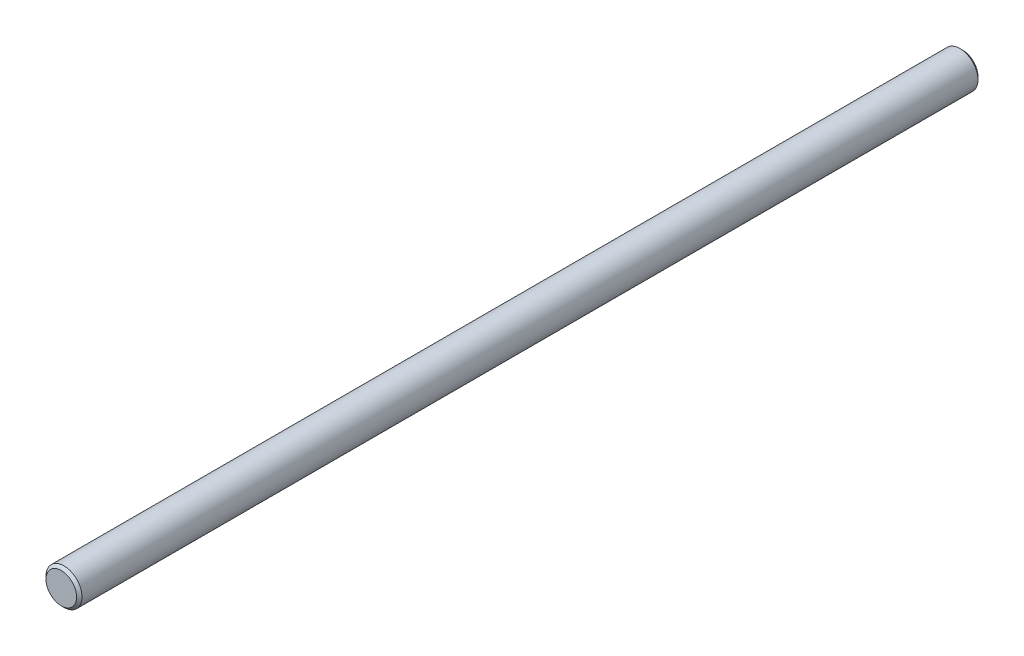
ISO-10303-21;
HEADER;
FILE_DESCRIPTION(('STEP AP214'),'2;1');
FILE_NAME('part.step','',(''),(''),'','','');
FILE_SCHEMA(('AUTOMOTIVE_DESIGN { 1 0 10303 214 1 1 1 1 }'));
ENDSEC;
DATA;
#1=APPLICATION_CONTEXT('core data for automotive mechanical design processes');
#2=APPLICATION_PROTOCOL_DEFINITION('international standard','automotive_design',2000,#1);
#3=PRODUCT_CONTEXT('',#1,'mechanical');
#4=PRODUCT('Part','Part','',(#3));
#5=PRODUCT_RELATED_PRODUCT_CATEGORY('part','',(#4));
#6=PRODUCT_DEFINITION_FORMATION('','',#4);
#7=PRODUCT_DEFINITION_CONTEXT('part definition',#1,'design');
#8=PRODUCT_DEFINITION('design','',#6,#7);
#9=PRODUCT_DEFINITION_SHAPE('','',#8);
#10=(LENGTH_UNIT() NAMED_UNIT(*) SI_UNIT(.MILLI.,.METRE.));
#11=(NAMED_UNIT(*) PLANE_ANGLE_UNIT() SI_UNIT($,.RADIAN.));
#12=(NAMED_UNIT(*) SI_UNIT($,.STERADIAN.) SOLID_ANGLE_UNIT());
#13=UNCERTAINTY_MEASURE_WITH_UNIT(LENGTH_MEASURE(1.E-05),#10,'distance_accuracy_value','');
#14=(GEOMETRIC_REPRESENTATION_CONTEXT(3) GLOBAL_UNCERTAINTY_ASSIGNED_CONTEXT((#13)) GLOBAL_UNIT_ASSIGNED_CONTEXT((#10,
#11,#12)) REPRESENTATION_CONTEXT('',''));
#15=CARTESIAN_POINT('',(0.,0.,0.));
#16=DIRECTION('',(0.,0.,1.));
#17=DIRECTION('',(1.,0.,0.));
#18=AXIS2_PLACEMENT_3D('',#15,#16,#17);
#19=CARTESIAN_POINT('',(0.,0.,100.));
#20=DIRECTION('',(0.,0.,-1.));
#21=DIRECTION('',(-1.,0.,0.));
#22=AXIS2_PLACEMENT_3D('',#19,#20,#21);
#23=CYLINDRICAL_SURFACE('',#22,2.);
#24=CARTESIAN_POINT('',(0.,0.,0.299999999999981));
#25=DIRECTION('',(0.,0.,1.));
#26=DIRECTION('',(1.,0.,0.));
#27=AXIS2_PLACEMENT_3D('',#24,#25,#26);
#28=CIRCLE('',#27,2.);
#29=CARTESIAN_POINT('',(2.,0.,0.299999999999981));
#30=VERTEX_POINT('',#29);
#31=EDGE_CURVE('E41',#30,#30,#28,.T.);
#32=ORIENTED_EDGE('',*,*,#31,.T.);
#33=EDGE_LOOP('',(#32));
#34=FACE_BOUND('',#33,.T.);
#35=CARTESIAN_POINT('',(0.,0.,99.7));
#36=DIRECTION('',(0.,0.,1.));
#37=DIRECTION('',(1.,0.,0.));
#38=AXIS2_PLACEMENT_3D('',#35,#36,#37);
#39=CIRCLE('',#38,2.);
#40=CARTESIAN_POINT('',(2.,0.,99.7));
#41=VERTEX_POINT('',#40);
#42=EDGE_CURVE('E45',#41,#41,#39,.F.);
#43=ORIENTED_EDGE('',*,*,#42,.T.);
#44=EDGE_LOOP('',(#43));
#45=FACE_BOUND('',#44,.T.);
#46=ADVANCED_FACE('F34',(#34,#45),#23,.T.);
#47=CARTESIAN_POINT('',(0.,0.,100.));
#48=DIRECTION('',(0.,0.,1.));
#49=DIRECTION('',(1.,0.,0.));
#50=AXIS2_PLACEMENT_3D('',#47,#48,#49);
#51=PLANE('',#50);
#52=CARTESIAN_POINT('',(0.,0.,100.));
#53=DIRECTION('',(0.,0.,1.));
#54=DIRECTION('',(1.,0.,0.));
#55=AXIS2_PLACEMENT_3D('',#52,#53,#54);
#56=CIRCLE('',#55,1.70000000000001);
#57=CARTESIAN_POINT('',(1.70000000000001,0.,100.));
#58=VERTEX_POINT('',#57);
#59=EDGE_CURVE('E49',#58,#58,#56,.T.);
#60=ORIENTED_EDGE('',*,*,#59,.T.);
#61=EDGE_LOOP('',(#60));
#62=FACE_BOUND('',#61,.T.);
#63=ADVANCED_FACE('F55',(#62),#51,.T.);
#64=CARTESIAN_POINT('',(0.,0.,0.));
#65=DIRECTION('',(0.,0.,1.));
#66=DIRECTION('',(1.,0.,0.));
#67=AXIS2_PLACEMENT_3D('',#64,#65,#66);
#68=PLANE('',#67);
#69=CARTESIAN_POINT('',(0.,0.,0.));
#70=DIRECTION('',(0.,0.,1.));
#71=DIRECTION('',(1.,0.,0.));
#72=AXIS2_PLACEMENT_3D('',#69,#70,#71);
#73=CIRCLE('',#72,1.70000000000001);
#74=CARTESIAN_POINT('',(1.70000000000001,0.,0.));
#75=VERTEX_POINT('',#74);
#76=EDGE_CURVE('E10',#75,#75,#73,.F.);
#77=ORIENTED_EDGE('',*,*,#76,.T.);
#78=EDGE_LOOP('',(#77));
#79=FACE_BOUND('',#78,.T.);
#80=ADVANCED_FACE('F59',(#79),#68,.F.);
#81=CARTESIAN_POINT('',(0.,0.,100.));
#82=DIRECTION('',(0.,0.,-1.));
#83=DIRECTION('',(-1.,0.,0.));
#84=AXIS2_PLACEMENT_3D('',#81,#82,#83);
#85=CONICAL_SURFACE('',#84,1.70000000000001,0.785398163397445);
#86=ORIENTED_EDGE('',*,*,#42,.F.);
#87=EDGE_LOOP('',(#86));
#88=FACE_BOUND('',#87,.T.);
#89=ORIENTED_EDGE('',*,*,#59,.F.);
#90=EDGE_LOOP('',(#89));
#91=FACE_BOUND('',#90,.T.);
#92=ADVANCED_FACE('F57',(#88,#91),#85,.T.);
#93=CARTESIAN_POINT('',(0.,0.,0.299999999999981));
#94=DIRECTION('',(0.,0.,1.));
#95=DIRECTION('',(1.,0.,0.));
#96=AXIS2_PLACEMENT_3D('',#93,#94,#95);
#97=CONICAL_SURFACE('',#96,2.,0.785398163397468);
#98=ORIENTED_EDGE('',*,*,#76,.F.);
#99=EDGE_LOOP('',(#98));
#100=FACE_BOUND('',#99,.T.);
#101=ORIENTED_EDGE('',*,*,#31,.F.);
#102=EDGE_LOOP('',(#101));
#103=FACE_BOUND('',#102,.T.);
#104=ADVANCED_FACE('F36',(#100,#103),#97,.T.);
#105=CLOSED_SHELL('',(#46,#63,#80,#92,#104));
#106=MANIFOLD_SOLID_BREP('B2',#105);
#107=ADVANCED_BREP_SHAPE_REPRESENTATION('',(#18,#106),#14);
#108=SHAPE_DEFINITION_REPRESENTATION(#9,#107);
ENDSEC;
END-ISO-10303-21;
